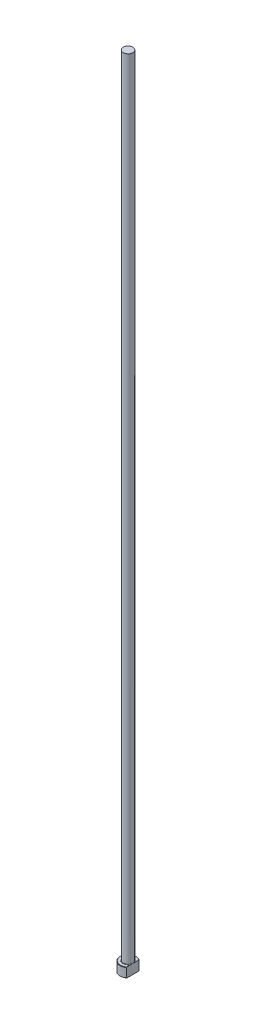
ISO-10303-21;
HEADER;
FILE_DESCRIPTION(('STEP AP214'),'2;1');
FILE_NAME('part.step','',(''),(''),'','','');
FILE_SCHEMA(('AUTOMOTIVE_DESIGN { 1 0 10303 214 1 1 1 1 }'));
ENDSEC;
DATA;
#1=APPLICATION_CONTEXT('core data for automotive mechanical design processes');
#2=APPLICATION_PROTOCOL_DEFINITION('international standard','automotive_design',2000,#1);
#3=PRODUCT_CONTEXT('',#1,'mechanical');
#4=PRODUCT('Part','Part','',(#3));
#5=PRODUCT_RELATED_PRODUCT_CATEGORY('part','',(#4));
#6=PRODUCT_DEFINITION_FORMATION('','',#4);
#7=PRODUCT_DEFINITION_CONTEXT('part definition',#1,'design');
#8=PRODUCT_DEFINITION('design','',#6,#7);
#9=PRODUCT_DEFINITION_SHAPE('','',#8);
#10=(LENGTH_UNIT() NAMED_UNIT(*) SI_UNIT(.MILLI.,.METRE.));
#11=(NAMED_UNIT(*) PLANE_ANGLE_UNIT() SI_UNIT($,.RADIAN.));
#12=(NAMED_UNIT(*) SI_UNIT($,.STERADIAN.) SOLID_ANGLE_UNIT());
#13=UNCERTAINTY_MEASURE_WITH_UNIT(LENGTH_MEASURE(1.E-05),#10,'distance_accuracy_value','');
#14=(GEOMETRIC_REPRESENTATION_CONTEXT(3) GLOBAL_UNCERTAINTY_ASSIGNED_CONTEXT((#13)) GLOBAL_UNIT_ASSIGNED_CONTEXT((#10,
#11,#12)) REPRESENTATION_CONTEXT('',''));
#15=CARTESIAN_POINT('',(0.,0.,0.));
#16=DIRECTION('',(0.,0.,1.));
#17=DIRECTION('',(1.,0.,0.));
#18=AXIS2_PLACEMENT_3D('',#15,#16,#17);
#19=CARTESIAN_POINT('',(0.,0.,0.));
#20=DIRECTION('',(0.,-1.,0.));
#21=DIRECTION('',(0.,0.,-1.));
#22=AXIS2_PLACEMENT_3D('',#19,#20,#21);
#23=PLANE('',#22);
#24=CARTESIAN_POINT('',(0.,0.,0.));
#25=DIRECTION('',(0.,-1.,0.));
#26=DIRECTION('',(0.,0.,-1.));
#27=AXIS2_PLACEMENT_3D('',#24,#25,#26);
#28=CIRCLE('',#27,4.79999999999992);
#29=CARTESIAN_POINT('',(2.99999999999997,0.,3.74699879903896));
#30=VERTEX_POINT('',#29);
#31=CARTESIAN_POINT('',(2.99999999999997,0.,-3.74699879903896));
#32=VERTEX_POINT('',#31);
#33=EDGE_CURVE('E98',#30,#32,#28,.T.);
#34=ORIENTED_EDGE('',*,*,#33,.T.);
#35=DIRECTION('',(0.,0.,1.));
#36=VECTOR('',#35,1.);
#37=CARTESIAN_POINT('',(2.99999999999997,0.,3.99999999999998));
#38=LINE('',#37,#36);
#39=EDGE_CURVE('E83',#32,#30,#38,.T.);
#40=ORIENTED_EDGE('',*,*,#39,.T.);
#41=EDGE_LOOP('',(#34,#40));
#42=FACE_BOUND('',#41,.T.);
#43=ADVANCED_FACE('F32',(#42),#23,.T.);
#44=CARTESIAN_POINT('',(0.,259.958771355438,0.));
#45=DIRECTION('',(0.,1.,0.));
#46=DIRECTION('',(0.,0.,1.));
#47=AXIS2_PLACEMENT_3D('',#44,#45,#46);
#48=CYLINDRICAL_SURFACE('',#47,4.99999999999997);
#49=CARTESIAN_POINT('',(0.,5.79999999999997,0.));
#50=DIRECTION('',(0.,1.,0.));
#51=DIRECTION('',(0.,0.,1.));
#52=AXIS2_PLACEMENT_3D('',#49,#50,#51);
#53=CIRCLE('',#52,4.99999999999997);
#54=CARTESIAN_POINT('',(2.99999999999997,5.79999999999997,3.99999999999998));
#55=VERTEX_POINT('',#54);
#56=CARTESIAN_POINT('',(2.99999999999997,5.79999999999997,-3.99999999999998));
#57=VERTEX_POINT('',#56);
#58=EDGE_CURVE('E104',#55,#57,#53,.F.);
#59=ORIENTED_EDGE('',*,*,#58,.T.);
#60=DIRECTION('',(0.,-1.,0.));
#61=VECTOR('',#60,1.);
#62=CARTESIAN_POINT('',(2.99999999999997,500.,-3.99999999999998));
#63=LINE('',#62,#61);
#64=CARTESIAN_POINT('',(2.99999999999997,0.200000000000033,-3.99999999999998));
#65=VERTEX_POINT('',#64);
#66=EDGE_CURVE('E183',#57,#65,#63,.T.);
#67=ORIENTED_EDGE('',*,*,#66,.T.);
#68=CARTESIAN_POINT('',(0.,0.200000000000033,0.));
#69=DIRECTION('',(0.,-1.,0.));
#70=DIRECTION('',(0.,0.,-1.));
#71=AXIS2_PLACEMENT_3D('',#68,#69,#70);
#72=CIRCLE('',#71,4.99999999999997);
#73=CARTESIAN_POINT('',(2.99999999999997,0.200000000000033,3.99999999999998));
#74=VERTEX_POINT('',#73);
#75=EDGE_CURVE('E100',#65,#74,#72,.F.);
#76=ORIENTED_EDGE('',*,*,#75,.T.);
#77=DIRECTION('',(0.,-1.,0.));
#78=VECTOR('',#77,1.);
#79=CARTESIAN_POINT('',(2.99999999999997,500.,3.99999999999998));
#80=LINE('',#79,#78);
#81=EDGE_CURVE('E93',#55,#74,#80,.T.);
#82=ORIENTED_EDGE('',*,*,#81,.F.);
#83=EDGE_LOOP('',(#59,#67,#76,#82));
#84=FACE_BOUND('',#83,.T.);
#85=ADVANCED_FACE('F158',(#84),#48,.T.);
#86=CARTESIAN_POINT('',(-4.99999999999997,6.,0.));
#87=DIRECTION('',(0.,1.,0.));
#88=DIRECTION('',(0.,0.,1.));
#89=AXIS2_PLACEMENT_3D('',#86,#87,#88);
#90=PLANE('',#89);
#91=CARTESIAN_POINT('',(0.,6.,0.));
#92=DIRECTION('',(0.,1.,0.));
#93=DIRECTION('',(0.,0.,1.));
#94=AXIS2_PLACEMENT_3D('',#91,#92,#93);
#95=CIRCLE('',#94,4.79999999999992);
#96=CARTESIAN_POINT('',(2.99999999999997,6.,-3.74699879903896));
#97=VERTEX_POINT('',#96);
#98=CARTESIAN_POINT('',(2.99999999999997,6.,3.74699879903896));
#99=VERTEX_POINT('',#98);
#100=EDGE_CURVE('E178',#97,#99,#95,.T.);
#101=ORIENTED_EDGE('',*,*,#100,.T.);
#102=DIRECTION('',(0.,0.,-1.));
#103=VECTOR('',#102,1.);
#104=CARTESIAN_POINT('',(2.99999999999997,6.,0.));
#105=LINE('',#104,#103);
#106=CARTESIAN_POINT('',(2.99999999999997,5.99999999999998,1.11355287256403));
#107=VERTEX_POINT('',#106);
#108=EDGE_CURVE('E57',#99,#107,#105,.T.);
#109=ORIENTED_EDGE('',*,*,#108,.T.);
#110=CARTESIAN_POINT('',(0.,6.,0.));
#111=DIRECTION('',(0.,1.,0.));
#112=DIRECTION('',(0.,0.,1.));
#113=AXIS2_PLACEMENT_3D('',#110,#111,#112);
#114=CIRCLE('',#113,3.19999999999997);
#115=CARTESIAN_POINT('',(2.99999999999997,5.99999999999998,-1.113552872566));
#116=VERTEX_POINT('',#115);
#117=EDGE_CURVE('E107',#107,#116,#114,.F.);
#118=ORIENTED_EDGE('',*,*,#117,.T.);
#119=EDGE_CURVE('E136',#116,#97,#105,.T.);
#120=ORIENTED_EDGE('',*,*,#119,.T.);
#121=EDGE_LOOP('',(#101,#109,#118,#120));
#122=FACE_BOUND('',#121,.T.);
#123=ADVANCED_FACE('F147',(#122),#90,.T.);
#124=CARTESIAN_POINT('',(0.,6.00000000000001,0.));
#125=DIRECTION('',(0.,-1.,0.));
#126=DIRECTION('',(0.,0.,-1.));
#127=AXIS2_PLACEMENT_3D('',#124,#125,#126);
#128=CONICAL_SURFACE('',#127,4.79999999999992,0.785398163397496);
#129=ORIENTED_EDGE('',*,*,#58,.F.);
#130=CARTESIAN_POINT('',(2.99999999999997,1.50107969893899,8.80169976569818));
#131=CARTESIAN_POINT('',(2.99999999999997,1.63686222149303,8.65824370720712));
#132=CARTESIAN_POINT('',(2.99999999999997,1.77246571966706,8.51461803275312));
#133=CARTESIAN_POINT('',(2.99999999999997,2.04325136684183,8.22696847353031));
#134=CARTESIAN_POINT('',(2.99999999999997,2.17843351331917,8.0829445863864));
#135=CARTESIAN_POINT('',(2.99999999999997,2.58356488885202,7.6498536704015));
#136=CARTESIAN_POINT('',(2.99999999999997,2.85278243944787,7.3601013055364));
#137=CARTESIAN_POINT('',(2.99999999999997,3.40003551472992,6.76562093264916));
#138=CARTESIAN_POINT('',(2.99999999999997,3.67795327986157,6.4607841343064));
#139=CARTESIAN_POINT('',(2.99999999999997,4.09143431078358,6.00077575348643));
#140=CARTESIAN_POINT('',(2.99999999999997,4.22862197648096,5.84706478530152));
#141=CARTESIAN_POINT('',(2.99999999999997,4.50164803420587,5.5384501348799));
#142=CARTESIAN_POINT('',(2.99999999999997,4.6374864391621,5.38354646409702));
#143=CARTESIAN_POINT('',(2.99999999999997,4.90727601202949,5.07249257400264));
#144=CARTESIAN_POINT('',(2.99999999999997,5.04122961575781,4.91634447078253));
#145=CARTESIAN_POINT('',(2.99999999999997,5.30697993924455,4.60220522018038));
#146=CARTESIAN_POINT('',(2.99999999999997,5.43877654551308,4.44421397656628));
#147=CARTESIAN_POINT('',(2.99999999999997,5.69999683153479,4.12534042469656));
#148=CARTESIAN_POINT('',(2.99999999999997,5.82941047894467,3.96444987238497));
#149=CARTESIAN_POINT('',(2.99999999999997,6.08438250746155,3.63966784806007));
#150=CARTESIAN_POINT('',(2.99999999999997,6.20994148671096,3.4757768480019));
#151=CARTESIAN_POINT('',(2.99999999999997,6.45325581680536,3.1473981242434));
#152=CARTESIAN_POINT('',(2.99999999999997,6.57111776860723,2.9829898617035));
#153=CARTESIAN_POINT('',(2.99999999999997,6.79968625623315,2.64903166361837));
#154=CARTESIAN_POINT('',(2.99999999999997,6.91038738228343,2.47947797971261));
#155=CARTESIAN_POINT('',(2.99999999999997,7.12046597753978,2.13484547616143));
#156=CARTESIAN_POINT('',(2.99999999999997,7.21990868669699,1.95980688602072));
#157=CARTESIAN_POINT('',(2.99999999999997,7.40271732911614,1.60161809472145));
#158=CARTESIAN_POINT('',(2.99999999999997,7.48611382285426,1.41848414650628));
#159=CARTESIAN_POINT('',(2.99999999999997,7.59087391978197,1.14242184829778));
#160=CARTESIAN_POINT('',(2.99999999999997,7.62169870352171,1.05308812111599));
#161=CARTESIAN_POINT('',(2.99999999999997,7.67691431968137,0.872393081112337));
#162=CARTESIAN_POINT('',(2.99999999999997,7.70130307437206,0.781031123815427));
#163=CARTESIAN_POINT('',(2.99999999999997,7.74245942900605,0.597105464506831));
#164=CARTESIAN_POINT('',(2.99999999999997,7.75926776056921,0.504551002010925));
#165=CARTESIAN_POINT('',(2.99999999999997,7.78456917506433,0.318316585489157));
#166=CARTESIAN_POINT('',(2.99999999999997,7.79306431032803,0.224636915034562));
#167=CARTESIAN_POINT('',(2.99999999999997,7.80126723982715,0.0362345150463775));
#168=CARTESIAN_POINT('',(2.99999999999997,7.80091364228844,-0.0584909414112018));
#169=CARTESIAN_POINT('',(2.99999999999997,7.7912899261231,-0.247479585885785));
#170=CARTESIAN_POINT('',(2.99999999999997,7.78201974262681,-0.341742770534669));
#171=CARTESIAN_POINT('',(2.99999999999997,7.75505711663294,-0.529484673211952));
#172=CARTESIAN_POINT('',(2.99999999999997,7.73732579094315,-0.622957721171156));
#173=CARTESIAN_POINT('',(2.99999999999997,7.69436193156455,-0.808152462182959));
#174=CARTESIAN_POINT('',(2.99999999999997,7.66912783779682,-0.899873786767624));
#175=CARTESIAN_POINT('',(2.99999999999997,7.59536615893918,-1.13513447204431));
#176=CARTESIAN_POINT('',(2.99999999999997,7.54190202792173,-1.27712290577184));
#177=CARTESIAN_POINT('',(2.99999999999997,7.42288064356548,-1.55591594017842));
#178=CARTESIAN_POINT('',(2.99999999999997,7.35731341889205,-1.69271615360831));
#179=CARTESIAN_POINT('',(2.99999999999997,7.21673004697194,-1.96297343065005));
#180=CARTESIAN_POINT('',(2.99999999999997,7.14163008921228,-2.09638641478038));
#181=CARTESIAN_POINT('',(2.99999999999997,7.0240988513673,-2.29351148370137));
#182=CARTESIAN_POINT('',(2.99999999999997,6.98411579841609,-2.35870939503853));
#183=CARTESIAN_POINT('',(2.99999999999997,6.90273519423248,-2.48821412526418));
#184=CARTESIAN_POINT('',(2.99999999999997,6.86133769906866,-2.55252097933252));
#185=CARTESIAN_POINT('',(2.99999999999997,6.72108058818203,-2.7659208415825));
#186=CARTESIAN_POINT('',(2.99999999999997,6.61950942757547,-2.91323263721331));
#187=CARTESIAN_POINT('',(2.99999999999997,6.41158682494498,-3.20445576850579));
#188=CARTESIAN_POINT('',(2.99999999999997,6.3052343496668,-3.3483663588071));
#189=CARTESIAN_POINT('',(2.99999999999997,6.08891481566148,-3.63358820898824));
#190=CARTESIAN_POINT('',(2.99999999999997,5.97894537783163,-3.77489765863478));
#191=CARTESIAN_POINT('',(2.99999999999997,5.75630759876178,-4.05537908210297));
#192=CARTESIAN_POINT('',(2.99999999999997,5.64363910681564,-4.19455093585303));
#193=CARTESIAN_POINT('',(2.99999999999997,5.41585487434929,-4.47160548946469));
#194=CARTESIAN_POINT('',(2.99999999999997,5.30073257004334,-4.6094827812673));
#195=CARTESIAN_POINT('',(2.99999999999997,5.06881951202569,-4.88382857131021));
#196=CARTESIAN_POINT('',(2.99999999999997,4.95202872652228,-5.02029704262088));
#197=CARTESIAN_POINT('',(2.99999999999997,4.59976429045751,-5.42786401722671));
#198=CARTESIAN_POINT('',(2.99999999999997,4.36230070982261,-5.69724186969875));
#199=CARTESIAN_POINT('',(2.99999999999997,3.90791057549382,-6.20584337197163));
#200=CARTESIAN_POINT('',(2.99999999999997,3.69132371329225,-6.4453721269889));
#201=CARTESIAN_POINT('',(2.99999999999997,3.2560075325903,-6.92252604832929));
#202=CARTESIAN_POINT('',(2.99999999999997,3.03727796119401,-7.16015098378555));
#203=CARTESIAN_POINT('',(2.99999999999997,2.59963438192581,-7.63242038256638));
#204=CARTESIAN_POINT('',(2.99999999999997,2.38073043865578,-7.86707418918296));
#205=CARTESIAN_POINT('',(2.99999999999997,1.9417265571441,-8.33519393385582));
#206=CARTESIAN_POINT('',(2.99999999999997,1.7216268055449,-8.56866004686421));
#207=CARTESIAN_POINT('',(2.99999999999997,1.50107969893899,-8.80169976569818));
#208=B_SPLINE_CURVE_WITH_KNOTS('',3,(#130,#131,#132,#133,#134,#135,#136,#137,#138,#139,#140,
#141,#142,#143,#144,#145,#146,#147,#148,#149,#150,#151,#152,#153,#154,#155,#156,#157,#158,#159,
#160,#161,#162,#163,#164,#165,#166,#167,#168,#169,#170,#171,#172,#173,#174,#175,#176,#177,#178,
#179,#180,#181,#182,#183,#184,#185,#186,#187,#188,#189,#190,#191,#192,#193,#194,#195,#196,#197,
#198,#199,#200,#201,#202,#203,#204,#205,#206,#207),.UNSPECIFIED.,.F.,.F.,(4,2,2,2,2,2,2,2,2,2,2,
2,2,2,2,2,2,2,2,2,2,2,2,2,2,2,2,2,2,2,2,2,2,2,2,2,2,2,4),(0.,0.5925780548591,1.18515965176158,
2.37170329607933,3.60919781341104,4.22727570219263,4.84534766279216,5.46252965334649,
6.07974401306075,6.69913968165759,7.31843874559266,7.92518229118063,8.5323789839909,
9.135854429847,9.73816890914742,10.0214813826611,10.3048852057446,10.5867475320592,
10.8685402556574,11.152288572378,11.436038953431,11.7211060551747,12.0062324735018,
12.4605654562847,12.9152744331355,13.3743011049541,13.6037325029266,13.8331548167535,
14.3698070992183,14.9065759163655,15.4437051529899,15.9808644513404,16.5197074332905,
17.0585606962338,18.1358079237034,19.1045853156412,20.0734784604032,21.0361950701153,
21.9987655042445),.UNSPECIFIED.);
#209=EDGE_CURVE('E135',#55,#99,#208,.T.);
#210=ORIENTED_EDGE('',*,*,#209,.T.);
#211=ORIENTED_EDGE('',*,*,#100,.F.);
#212=EDGE_CURVE('E127',#97,#57,#208,.T.);
#213=ORIENTED_EDGE('',*,*,#212,.T.);
#214=EDGE_LOOP('',(#129,#210,#211,#213));
#215=FACE_BOUND('',#214,.T.);
#216=ADVANCED_FACE('F143',(#215),#128,.T.);
#217=CARTESIAN_POINT('',(0.,0.200000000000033,0.));
#218=DIRECTION('',(0.,1.,0.));
#219=DIRECTION('',(0.,0.,1.));
#220=AXIS2_PLACEMENT_3D('',#217,#218,#219);
#221=CONICAL_SURFACE('',#220,4.99999999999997,0.785398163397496);
#222=ORIENTED_EDGE('',*,*,#75,.F.);
#223=CARTESIAN_POINT('',(2.99999999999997,4.49892030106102,-8.80169976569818));
#224=CARTESIAN_POINT('',(2.99999999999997,4.36313777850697,-8.65824370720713));
#225=CARTESIAN_POINT('',(2.99999999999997,4.22753428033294,-8.51461803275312));
#226=CARTESIAN_POINT('',(2.99999999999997,3.95674863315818,-8.22696847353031));
#227=CARTESIAN_POINT('',(2.99999999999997,3.82156648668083,-8.0829445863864));
#228=CARTESIAN_POINT('',(2.99999999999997,3.41643511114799,-7.6498536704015));
#229=CARTESIAN_POINT('',(2.99999999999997,3.14721756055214,-7.3601013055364));
#230=CARTESIAN_POINT('',(2.99999999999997,2.59996448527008,-6.76562093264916));
#231=CARTESIAN_POINT('',(2.99999999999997,2.32204672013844,-6.4607841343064));
#232=CARTESIAN_POINT('',(2.99999999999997,1.90856568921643,-6.00077575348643));
#233=CARTESIAN_POINT('',(2.99999999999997,1.77137802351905,-5.84706478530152));
#234=CARTESIAN_POINT('',(2.99999999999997,1.49835196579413,-5.5384501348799));
#235=CARTESIAN_POINT('',(2.99999999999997,1.36251356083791,-5.38354646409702));
#236=CARTESIAN_POINT('',(2.99999999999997,1.09272398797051,-5.07249257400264));
#237=CARTESIAN_POINT('',(2.99999999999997,0.9587703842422,-4.91634447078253));
#238=CARTESIAN_POINT('',(2.99999999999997,0.693020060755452,-4.60220522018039));
#239=CARTESIAN_POINT('',(2.99999999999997,0.561223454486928,-4.44421397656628));
#240=CARTESIAN_POINT('',(2.99999999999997,0.300003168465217,-4.12534042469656));
#241=CARTESIAN_POINT('',(2.99999999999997,0.170589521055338,-3.96444987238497));
#242=CARTESIAN_POINT('',(2.99999999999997,-0.084382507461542,-3.63966784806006));
#243=CARTESIAN_POINT('',(2.99999999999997,-0.209941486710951,-3.4757768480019));
#244=CARTESIAN_POINT('',(2.99999999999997,-0.453255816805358,-3.1473981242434));
#245=CARTESIAN_POINT('',(2.99999999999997,-0.571117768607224,-2.9829898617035));
#246=CARTESIAN_POINT('',(2.99999999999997,-0.799686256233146,-2.64903166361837));
#247=CARTESIAN_POINT('',(2.99999999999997,-0.910387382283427,-2.47947797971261));
#248=CARTESIAN_POINT('',(2.99999999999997,-1.12046597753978,-2.13484547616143));
#249=CARTESIAN_POINT('',(2.99999999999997,-1.21990868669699,-1.95980688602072));
#250=CARTESIAN_POINT('',(2.99999999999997,-1.40271732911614,-1.60161809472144));
#251=CARTESIAN_POINT('',(2.99999999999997,-1.48611382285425,-1.41848414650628));
#252=CARTESIAN_POINT('',(2.99999999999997,-1.59087391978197,-1.14242184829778));
#253=CARTESIAN_POINT('',(2.99999999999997,-1.62169870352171,-1.05308812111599));
#254=CARTESIAN_POINT('',(2.99999999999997,-1.67691431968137,-0.872393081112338));
#255=CARTESIAN_POINT('',(2.99999999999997,-1.70130307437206,-0.781031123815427));
#256=CARTESIAN_POINT('',(2.99999999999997,-1.74245942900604,-0.59710546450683));
#257=CARTESIAN_POINT('',(2.99999999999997,-1.7592677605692,-0.504551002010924));
#258=CARTESIAN_POINT('',(2.99999999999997,-1.78456917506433,-0.318316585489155));
#259=CARTESIAN_POINT('',(2.99999999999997,-1.79306431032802,-0.22463691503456));
#260=CARTESIAN_POINT('',(2.99999999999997,-1.80126723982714,-0.0362345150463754));
#261=CARTESIAN_POINT('',(2.99999999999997,-1.80091364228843,0.0584909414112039));
#262=CARTESIAN_POINT('',(2.99999999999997,-1.79128992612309,0.247479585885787));
#263=CARTESIAN_POINT('',(2.99999999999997,-1.7820197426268,0.341742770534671));
#264=CARTESIAN_POINT('',(2.99999999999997,-1.75505711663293,0.529484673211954));
#265=CARTESIAN_POINT('',(2.99999999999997,-1.73732579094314,0.622957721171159));
#266=CARTESIAN_POINT('',(2.99999999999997,-1.69436193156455,0.808152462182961));
#267=CARTESIAN_POINT('',(2.99999999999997,-1.66912783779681,0.899873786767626));
#268=CARTESIAN_POINT('',(2.99999999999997,-1.59536615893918,1.13513447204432));
#269=CARTESIAN_POINT('',(2.99999999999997,-1.54190202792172,1.27712290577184));
#270=CARTESIAN_POINT('',(2.99999999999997,-1.42288064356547,1.55591594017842));
#271=CARTESIAN_POINT('',(2.99999999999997,-1.35731341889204,1.69271615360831));
#272=CARTESIAN_POINT('',(2.99999999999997,-1.21673004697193,1.96297343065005));
#273=CARTESIAN_POINT('',(2.99999999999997,-1.14163008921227,2.09638641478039));
#274=CARTESIAN_POINT('',(2.99999999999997,-1.02409885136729,2.29351148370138));
#275=CARTESIAN_POINT('',(2.99999999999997,-0.98411579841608,2.35870939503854));
#276=CARTESIAN_POINT('',(2.99999999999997,-0.902735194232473,2.48821412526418));
#277=CARTESIAN_POINT('',(2.99999999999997,-0.861337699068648,2.55252097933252));
#278=CARTESIAN_POINT('',(2.99999999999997,-0.721080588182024,2.7659208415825));
#279=CARTESIAN_POINT('',(2.99999999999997,-0.619509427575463,2.91323263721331));
#280=CARTESIAN_POINT('',(2.99999999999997,-0.411586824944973,3.20445576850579));
#281=CARTESIAN_POINT('',(2.99999999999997,-0.305234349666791,3.3483663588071));
#282=CARTESIAN_POINT('',(2.99999999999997,-0.0889148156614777,3.63358820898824));
#283=CARTESIAN_POINT('',(2.99999999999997,0.0210546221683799,3.77489765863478));
#284=CARTESIAN_POINT('',(2.99999999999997,0.24369240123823,4.05537908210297));
#285=CARTESIAN_POINT('',(2.99999999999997,0.356360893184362,4.19455093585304));
#286=CARTESIAN_POINT('',(2.99999999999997,0.584145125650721,4.47160548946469));
#287=CARTESIAN_POINT('',(2.99999999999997,0.699267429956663,4.6094827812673));
#288=CARTESIAN_POINT('',(2.99999999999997,0.931180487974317,4.88382857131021));
#289=CARTESIAN_POINT('',(2.99999999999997,1.04797127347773,5.02029704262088));
#290=CARTESIAN_POINT('',(2.99999999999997,1.40023570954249,5.42786401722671));
#291=CARTESIAN_POINT('',(2.99999999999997,1.6376992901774,5.69724186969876));
#292=CARTESIAN_POINT('',(2.99999999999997,2.09208942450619,6.20584337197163));
#293=CARTESIAN_POINT('',(2.99999999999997,2.30867628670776,6.44537212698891));
#294=CARTESIAN_POINT('',(2.99999999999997,2.7439924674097,6.92252604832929));
#295=CARTESIAN_POINT('',(2.99999999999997,2.96272203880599,7.16015098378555));
#296=CARTESIAN_POINT('',(2.99999999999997,3.4003656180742,7.63242038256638));
#297=CARTESIAN_POINT('',(2.99999999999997,3.61926956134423,7.86707418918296));
#298=CARTESIAN_POINT('',(2.99999999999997,4.05827344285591,8.33519393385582));
#299=CARTESIAN_POINT('',(2.99999999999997,4.27837319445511,8.56866004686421));
#300=CARTESIAN_POINT('',(2.99999999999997,4.49892030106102,8.80169976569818));
#301=B_SPLINE_CURVE_WITH_KNOTS('',3,(#223,#224,#225,#226,#227,#228,#229,#230,#231,#232,#233,
#234,#235,#236,#237,#238,#239,#240,#241,#242,#243,#244,#245,#246,#247,#248,#249,#250,#251,#252,
#253,#254,#255,#256,#257,#258,#259,#260,#261,#262,#263,#264,#265,#266,#267,#268,#269,#270,#271,
#272,#273,#274,#275,#276,#277,#278,#279,#280,#281,#282,#283,#284,#285,#286,#287,#288,#289,#290,
#291,#292,#293,#294,#295,#296,#297,#298,#299,#300),.UNSPECIFIED.,.F.,.F.,(4,2,2,2,2,2,2,2,2,2,2,
2,2,2,2,2,2,2,2,2,2,2,2,2,2,2,2,2,2,2,2,2,2,2,2,2,2,2,4),(0.,0.5925780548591,1.18515965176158,
2.37170329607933,3.60919781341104,4.22727570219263,4.84534766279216,5.46252965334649,
6.07974401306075,6.6991396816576,7.31843874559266,7.92518229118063,8.53237898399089,
9.135854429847,9.73816890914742,10.0214813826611,10.3048852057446,10.5867475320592,
10.8685402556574,11.152288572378,11.436038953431,11.7211060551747,12.0062324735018,
12.4605654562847,12.9152744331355,13.3743011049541,13.6037325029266,13.8331548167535,
14.3698070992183,14.9065759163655,15.4437051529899,15.9808644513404,16.5197074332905,
17.0585606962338,18.1358079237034,19.1045853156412,20.0734784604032,21.0361950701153,
21.9987655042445),.UNSPECIFIED.);
#302=EDGE_CURVE('E86',#65,#32,#301,.T.);
#303=ORIENTED_EDGE('',*,*,#302,.T.);
#304=ORIENTED_EDGE('',*,*,#33,.F.);
#305=EDGE_CURVE('E89',#30,#74,#301,.T.);
#306=ORIENTED_EDGE('',*,*,#305,.T.);
#307=EDGE_LOOP('',(#222,#303,#304,#306));
#308=FACE_BOUND('',#307,.T.);
#309=ADVANCED_FACE('F97',(#308),#221,.T.);
#310=CARTESIAN_POINT('',(0.,6.19999999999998,0.));
#311=DIRECTION('',(0.,1.,0.));
#312=DIRECTION('',(0.,0.,1.));
#313=AXIS2_PLACEMENT_3D('',#310,#311,#312);
#314=TOROIDAL_SURFACE('',#313,3.19999999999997,0.2);
#315=CARTESIAN_POINT('',(2.99999999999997,6.19999999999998,0.));
#316=CARTESIAN_POINT('',(2.99999999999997,6.20000054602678,-8.25590029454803E-09));
#317=CARTESIAN_POINT('',(2.99999999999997,6.20000108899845,-2.22623717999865E-07));
#318=CARTESIAN_POINT('',(2.99999999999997,6.20000210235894,-8.13181332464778E-07));
#319=CARTESIAN_POINT('',(2.99999999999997,6.20000256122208,-1.20262210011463E-06));
#320=CARTESIAN_POINT('',(2.99999999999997,6.20000351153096,-2.13233194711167E-06));
#321=CARTESIAN_POINT('',(2.99999999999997,6.20000398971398,-2.68711080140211E-06));
#322=CARTESIAN_POINT('',(2.99999999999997,6.20000484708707,-3.8372299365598E-06));
#323=CARTESIAN_POINT('',(2.99999999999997,6.20000522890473,-4.43075975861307E-06));
#324=CARTESIAN_POINT('',(2.99999999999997,6.20000663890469,-6.718054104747E-06));
#325=CARTESIAN_POINT('',(2.99999999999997,6.20000758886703,-8.46267334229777E-06));
#326=CARTESIAN_POINT('',(2.99999999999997,6.20000915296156,-1.19195939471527E-05));
#327=CARTESIAN_POINT('',(2.99999999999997,6.20000978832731,-1.36226968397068E-05));
#328=CARTESIAN_POINT('',(2.99999999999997,6.20001243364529,-2.07785329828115E-05));
#329=CARTESIAN_POINT('',(2.99999999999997,6.20001439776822,-2.62512689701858E-05));
#330=CARTESIAN_POINT('',(2.99999999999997,6.20001730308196,-3.65971254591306E-05));
#331=CARTESIAN_POINT('',(2.99999999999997,6.20001835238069,-4.14397204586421E-05));
#332=CARTESIAN_POINT('',(2.99999999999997,6.20002589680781,-7.68826112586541E-05));
#333=CARTESIAN_POINT('',(2.99999999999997,6.20003169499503,-0.000107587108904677));
#334=CARTESIAN_POINT('',(2.99999999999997,6.20005649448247,-0.000225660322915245));
#335=CARTESIAN_POINT('',(2.99999999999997,6.20007997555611,-0.000312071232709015));
#336=CARTESIAN_POINT('',(2.99999999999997,6.20016717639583,-0.00063874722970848));
#337=CARTESIAN_POINT('',(2.99999999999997,6.20022823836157,-0.00087949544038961));
#338=CARTESIAN_POINT('',(2.99999999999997,6.20046253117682,-0.00179757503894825));
#339=CARTESIAN_POINT('',(2.99999999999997,6.20063826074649,-0.00247448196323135));
#340=CARTESIAN_POINT('',(2.99999999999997,6.20145771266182,-0.00563611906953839));
#341=CARTESIAN_POINT('',(2.99999999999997,6.20209802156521,-0.00812138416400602));
#342=CARTESIAN_POINT('',(2.99999999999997,6.20747052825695,-0.0289666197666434));
#343=CARTESIAN_POINT('',(2.99999999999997,6.21221441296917,-0.0473249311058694));
#344=CARTESIAN_POINT('',(2.99999999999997,6.22150414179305,-0.0833908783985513));
#345=CARTESIAN_POINT('',(2.99999999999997,6.22605099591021,-0.101098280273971));
#346=CARTESIAN_POINT('',(2.99999999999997,6.24071513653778,-0.158441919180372));
#347=CARTESIAN_POINT('',(2.99999999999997,6.25076238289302,-0.198096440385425));
#348=CARTESIAN_POINT('',(2.99999999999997,6.2673587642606,-0.264903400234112));
#349=CARTESIAN_POINT('',(2.99999999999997,6.27400650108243,-0.292031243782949));
#350=CARTESIAN_POINT('',(2.99999999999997,6.28691139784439,-0.345693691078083));
#351=CARTESIAN_POINT('',(2.99999999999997,6.2931740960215,-0.372226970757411));
#352=CARTESIAN_POINT('',(2.99999999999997,6.31359314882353,-0.460847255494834));
#353=CARTESIAN_POINT('',(2.99999999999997,6.32711949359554,-0.523084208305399));
#354=CARTESIAN_POINT('',(2.99999999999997,6.35185224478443,-0.648627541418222));
#355=CARTESIAN_POINT('',(2.99999999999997,6.36303576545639,-0.711938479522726));
#356=CARTESIAN_POINT('',(2.99999999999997,6.38269719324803,-0.845442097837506));
#357=CARTESIAN_POINT('',(2.99999999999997,6.39079783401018,-0.915695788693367));
#358=CARTESIAN_POINT('',(2.99999999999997,6.39788104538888,-1.02128246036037));
#359=CARTESIAN_POINT('',(2.99999999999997,6.39939945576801,-1.05644278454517));
#360=CARTESIAN_POINT('',(2.99999999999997,6.40031405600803,-1.12678521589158));
#361=CARTESIAN_POINT('',(2.99999999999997,6.39971158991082,-1.16196729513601));
#362=CARTESIAN_POINT('',(2.99999999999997,6.39660553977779,-1.21713951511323));
#363=CARTESIAN_POINT('',(2.99999999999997,6.39502683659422,-1.23718181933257));
#364=CARTESIAN_POINT('',(2.99999999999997,6.39080008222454,-1.27717351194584));
#365=CARTESIAN_POINT('',(2.99999999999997,6.38815120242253,-1.29712281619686));
#366=CARTESIAN_POINT('',(2.99999999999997,6.38160570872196,-1.33655702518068));
#367=CARTESIAN_POINT('',(2.99999999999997,6.37772556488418,-1.35604460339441));
#368=CARTESIAN_POINT('',(2.99999999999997,6.36841119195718,-1.39463554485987));
#369=CARTESIAN_POINT('',(2.99999999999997,6.36297874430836,-1.41373932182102));
#370=CARTESIAN_POINT('',(2.99999999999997,6.3500393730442,-1.45151809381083));
#371=CARTESIAN_POINT('',(2.99999999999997,6.34250654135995,-1.4701843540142));
#372=CARTESIAN_POINT('',(2.99999999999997,6.32469433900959,-1.50617232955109));
#373=CARTESIAN_POINT('',(2.99999999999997,6.31442814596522,-1.52349999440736));
#374=CARTESIAN_POINT('',(2.99999999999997,6.29768486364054,-1.5453003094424));
#375=CARTESIAN_POINT('',(2.99999999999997,6.29285641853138,-1.551032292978));
#376=CARTESIAN_POINT('',(2.99999999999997,6.28257691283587,-1.56192749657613));
#377=CARTESIAN_POINT('',(2.99999999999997,6.27712536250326,-1.56709026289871));
#378=CARTESIAN_POINT('',(2.99999999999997,6.26548354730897,-1.57666725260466));
#379=CARTESIAN_POINT('',(2.99999999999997,6.25928560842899,-1.58107232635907));
#380=CARTESIAN_POINT('',(2.99999999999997,6.24620912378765,-1.5887219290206));
#381=CARTESIAN_POINT('',(2.99999999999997,6.23933242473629,-1.59196950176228));
#382=CARTESIAN_POINT('',(2.99999999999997,6.2270240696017,-1.5962468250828));
#383=CARTESIAN_POINT('',(2.99999999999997,6.2217197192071,-1.59764171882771));
#384=CARTESIAN_POINT('',(2.99999999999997,6.2109516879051,-1.59951721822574));
#385=CARTESIAN_POINT('',(2.99999999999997,6.20548813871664,-1.59999855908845));
#386=CARTESIAN_POINT('',(2.99999999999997,6.19455397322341,-1.60000143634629));
#387=CARTESIAN_POINT('',(2.99999999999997,6.18908335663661,-1.59952177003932));
#388=CARTESIAN_POINT('',(2.99999999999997,6.17830149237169,-1.59764696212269));
#389=CARTESIAN_POINT('',(2.99999999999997,6.17299036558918,-1.59625114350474));
#390=CARTESIAN_POINT('',(2.99999999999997,6.16137413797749,-1.5922159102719));
#391=CARTESIAN_POINT('',(2.99999999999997,6.15514663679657,-1.58935479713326));
#392=CARTESIAN_POINT('',(2.99999999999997,6.14323789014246,-1.58266473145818));
#393=CARTESIAN_POINT('',(2.99999999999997,6.13755768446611,-1.57883398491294));
#394=CARTESIAN_POINT('',(2.99999999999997,6.12388989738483,-1.5682309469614));
#395=CARTESIAN_POINT('',(2.99999999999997,6.11627920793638,-1.5609769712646));
#396=CARTESIAN_POINT('',(2.99999999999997,6.10222993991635,-1.54541986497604));
#397=CARTESIAN_POINT('',(2.99999999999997,6.09579438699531,-1.53711411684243));
#398=CARTESIAN_POINT('',(2.99999999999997,6.07874447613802,-1.51234359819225));
#399=CARTESIAN_POINT('',(2.99999999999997,6.06934681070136,-1.49505024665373));
#400=CARTESIAN_POINT('',(2.99999999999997,6.05300413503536,-1.45936637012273));
#401=CARTESIAN_POINT('',(2.99999999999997,6.04606563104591,-1.44097308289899));
#402=CARTESIAN_POINT('',(2.99999999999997,6.03343712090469,-1.40170303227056));
#403=CARTESIAN_POINT('',(2.99999999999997,6.02794514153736,-1.38076360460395));
#404=CARTESIAN_POINT('',(2.99999999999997,6.01869119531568,-1.33849708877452));
#405=CARTESIAN_POINT('',(2.99999999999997,6.01493126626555,-1.31716957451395));
#406=CARTESIAN_POINT('',(2.99999999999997,6.00879575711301,-1.27427301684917));
#407=CARTESIAN_POINT('',(2.99999999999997,6.0064232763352,-1.25270354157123));
#408=CARTESIAN_POINT('',(2.99999999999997,6.00283272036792,-1.2094871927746));
#409=CARTESIAN_POINT('',(2.99999999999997,6.00161392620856,-1.18784037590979));
#410=CARTESIAN_POINT('',(2.99999999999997,5.99921193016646,-1.11739576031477));
#411=CARTESIAN_POINT('',(2.99999999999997,5.99998309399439,-1.06853061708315));
#412=CARTESIAN_POINT('',(2.99999999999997,6.0049845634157,-0.970964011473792));
#413=CARTESIAN_POINT('',(2.99999999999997,6.00921876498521,-0.922262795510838));
#414=CARTESIAN_POINT('',(2.99999999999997,6.02027934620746,-0.825023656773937));
#415=CARTESIAN_POINT('',(2.99999999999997,6.02711306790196,-0.776486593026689));
#416=CARTESIAN_POINT('',(2.99999999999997,6.04272509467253,-0.679720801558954));
#417=CARTESIAN_POINT('',(2.99999999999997,6.05150395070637,-0.631492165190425));
#418=CARTESIAN_POINT('',(2.99999999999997,6.07999589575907,-0.487173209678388));
#419=CARTESIAN_POINT('',(2.99999999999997,6.10185558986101,-0.39151417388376));
#420=CARTESIAN_POINT('',(2.99999999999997,6.14819769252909,-0.200831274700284));
#421=CARTESIAN_POINT('',(2.99999999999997,6.17268119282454,-0.105807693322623));
#422=CARTESIAN_POINT('',(2.99999999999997,6.19722910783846,-0.01073189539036));
#423=CARTESIAN_POINT('',(2.99999999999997,6.1972452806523,-0.0106692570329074));
#424=CARTESIAN_POINT('',(2.99999999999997,6.19781243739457,-0.00847232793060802));
#425=CARTESIAN_POINT('',(2.99999999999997,6.19836102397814,-0.00633759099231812));
#426=CARTESIAN_POINT('',(2.99999999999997,6.19915976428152,-0.00325873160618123));
#427=CARTESIAN_POINT('',(2.99999999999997,6.19940591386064,-0.0023138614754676));
#428=CARTESIAN_POINT('',(2.99999999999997,6.19972567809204,-0.00105818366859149));
#429=CARTESIAN_POINT('',(2.99999999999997,6.1998040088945,-0.000748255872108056));
#430=CARTESIAN_POINT('',(2.99999999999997,6.19991224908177,-0.0003408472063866));
#431=CARTESIAN_POINT('',(2.99999999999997,6.19993871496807,-0.000242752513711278));
#432=CARTESIAN_POINT('',(2.99999999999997,6.1999662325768,-0.000111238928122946));
#433=CARTESIAN_POINT('',(2.99999999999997,6.19997237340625,-7.8903777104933E-05));
#434=CARTESIAN_POINT('',(2.99999999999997,6.19998062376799,-4.17973013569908E-05));
#435=CARTESIAN_POINT('',(2.99999999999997,6.1999817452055,-3.68646326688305E-05));
#436=CARTESIAN_POINT('',(2.99999999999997,6.19998486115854,-2.63337098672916E-05));
#437=CARTESIAN_POINT('',(2.99999999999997,6.19998697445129,-2.07707790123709E-05));
#438=CARTESIAN_POINT('',(2.99999999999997,6.19998981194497,-1.35213137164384E-05));
#439=CARTESIAN_POINT('',(2.99999999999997,6.19999048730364,-1.18115060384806E-05));
#440=CARTESIAN_POINT('',(2.99999999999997,6.19999214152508,-8.34771964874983E-06));
#441=CARTESIAN_POINT('',(2.99999999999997,6.19999314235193,-6.60378872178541E-06));
#442=CARTESIAN_POINT('',(2.99999999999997,6.19999462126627,-4.32501646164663E-06));
#443=CARTESIAN_POINT('',(2.99999999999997,6.19999502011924,-3.73587510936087E-06));
#444=CARTESIAN_POINT('',(2.99999999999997,6.19999591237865,-2.59760769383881E-06));
#445=CARTESIAN_POINT('',(2.99999999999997,6.19999640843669,-2.05040430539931E-06));
#446=CARTESIAN_POINT('',(2.99999999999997,6.19999738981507,-1.1384674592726E-06));
#447=CARTESIAN_POINT('',(2.99999999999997,6.1999978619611,-7.58552555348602E-07));
#448=CARTESIAN_POINT('',(2.99999999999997,6.19999889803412,-1.92079007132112E-07));
#449=CARTESIAN_POINT('',(2.99999999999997,6.19999945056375,8.30745072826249E-09));
#450=CARTESIAN_POINT('',(2.99999999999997,6.19999999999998,0.));
#451=B_SPLINE_CURVE_WITH_KNOTS('',3,(#315,#316,#317,#318,#319,#320,#321,#322,#323,#324,#325,
#326,#327,#328,#329,#330,#331,#332,#333,#334,#335,#336,#337,#338,#339,#340,#341,#342,#343,#344,
#345,#346,#347,#348,#349,#350,#351,#352,#353,#354,#355,#356,#357,#358,#359,#360,#361,#362,#363,
#364,#365,#366,#367,#368,#369,#370,#371,#372,#373,#374,#375,#376,#377,#378,#379,#380,#381,#382,
#383,#384,#385,#386,#387,#388,#389,#390,#391,#392,#393,#394,#395,#396,#397,#398,#399,#400,#401,
#402,#403,#404,#405,#406,#407,#408,#409,#410,#411,#412,#413,#414,#415,#416,#417,#418,#419,#420,
#421,#422,#423,#424,#425,#426,#427,#428,#429,#430,#431,#432,#433,#434,#435,#436,#437,#438,#439,
#440,#441,#442,#443,#444,#445,#446,#447,#448,#449,#450),.UNSPECIFIED.,.T.,.F.,(4,2,2,2,2,2,2,2,
2,2,2,2,2,2,2,2,2,2,2,2,2,2,2,2,2,2,2,2,2,2,2,2,2,2,2,2,2,2,2,2,2,2,2,2,2,2,2,2,2,2,2,2,2,2,2,2,
2,2,2,2,2,2,2,2,2,2,2,4),(0.,1.65204690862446E-06,3.45848791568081E-06,5.64280248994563E-06,
7.75882419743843E-06,1.36969709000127E-05,1.91454439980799E-05,3.65603921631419E-05,
5.14083081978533E-05,0.000145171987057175,0.00041354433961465,0.00115890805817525,
0.00325667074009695,0.0109563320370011,0.0678386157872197,0.12268455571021,0.245405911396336,
0.329196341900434,0.410983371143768,0.602016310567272,0.794836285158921,1.0067376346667,
1.11227258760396,1.21774067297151,1.27803175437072,1.33836960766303,1.39793215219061,
1.45742661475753,1.51769013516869,1.57766822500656,1.60011625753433,1.62258205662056,
1.64530254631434,1.66796284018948,1.68434680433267,1.70071757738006,1.71710885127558,
1.7335122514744,1.75395806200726,1.77444198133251,1.8058056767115,1.83724902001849,
1.89596356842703,1.95483231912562,2.01967230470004,2.08458838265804,2.14964892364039,
2.21466889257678,2.36107995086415,2.50765595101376,2.65464904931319,2.8016838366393,
3.09594779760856,3.39033467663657,3.39052875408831,3.39714155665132,3.40007033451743,
3.40102967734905,3.40133420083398,3.40143296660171,3.40144812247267,3.4014659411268,
3.40147145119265,3.40147746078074,3.40147959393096,3.40148179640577,3.40148361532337,
3.40148527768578),.UNSPECIFIED.);
#452=CARTESIAN_POINT('',(2.99999999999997,6.19999999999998,0.));
#453=VERTEX_POINT('',#452);
#454=EDGE_CURVE('E11',#116,#453,#451,.T.);
#455=ORIENTED_EDGE('',*,*,#454,.F.);
#456=ORIENTED_EDGE('',*,*,#117,.F.);
#457=CARTESIAN_POINT('',(2.99999999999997,6.19999999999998,0.));
#458=CARTESIAN_POINT('',(2.99999999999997,6.19999945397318,8.25590052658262E-09));
#459=CARTESIAN_POINT('',(2.99999999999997,6.19999891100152,2.22623718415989E-07));
#460=CARTESIAN_POINT('',(2.99999999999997,6.19999789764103,8.13181332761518E-07));
#461=CARTESIAN_POINT('',(2.99999999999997,6.19999743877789,1.2026221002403E-06));
#462=CARTESIAN_POINT('',(2.99999999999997,6.19999648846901,2.13233194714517E-06));
#463=CARTESIAN_POINT('',(2.99999999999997,6.19999601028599,2.68711080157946E-06));
#464=CARTESIAN_POINT('',(2.99999999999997,6.1999951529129,3.83722993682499E-06));
#465=CARTESIAN_POINT('',(2.99999999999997,6.19999477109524,4.43075975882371E-06));
#466=CARTESIAN_POINT('',(2.99999999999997,6.19999336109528,6.7180541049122E-06));
#467=CARTESIAN_POINT('',(2.99999999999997,6.19999241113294,8.4626733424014E-06));
#468=CARTESIAN_POINT('',(2.99999999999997,6.19999084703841,1.19195939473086E-05));
#469=CARTESIAN_POINT('',(2.99999999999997,6.19999021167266,1.36226968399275E-05));
#470=CARTESIAN_POINT('',(2.99999999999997,6.19998756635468,2.07785329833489E-05));
#471=CARTESIAN_POINT('',(2.99999999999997,6.19998560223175,2.62512689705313E-05));
#472=CARTESIAN_POINT('',(2.99999999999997,6.19998269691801,3.65971254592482E-05));
#473=CARTESIAN_POINT('',(2.99999999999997,6.19998164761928,4.14397204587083E-05));
#474=CARTESIAN_POINT('',(2.99999999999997,6.19997410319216,7.68826112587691E-05));
#475=CARTESIAN_POINT('',(2.99999999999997,6.19996830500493,0.000107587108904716));
#476=CARTESIAN_POINT('',(2.99999999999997,6.1999435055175,0.000225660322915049));
#477=CARTESIAN_POINT('',(2.99999999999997,6.19992002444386,0.000312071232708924));
#478=CARTESIAN_POINT('',(2.99999999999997,6.19983282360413,0.000638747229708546));
#479=CARTESIAN_POINT('',(2.99999999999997,6.1997717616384,0.000879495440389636));
#480=CARTESIAN_POINT('',(2.99999999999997,6.19953746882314,0.00179757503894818));
#481=CARTESIAN_POINT('',(2.99999999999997,6.19936173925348,0.00247448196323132));
#482=CARTESIAN_POINT('',(2.99999999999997,6.19854228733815,0.0056361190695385));
#483=CARTESIAN_POINT('',(2.99999999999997,6.19790197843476,0.00812138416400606));
#484=CARTESIAN_POINT('',(2.99999999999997,6.19252947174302,0.0289666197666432));
#485=CARTESIAN_POINT('',(2.99999999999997,6.1877855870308,0.0473249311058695));
#486=CARTESIAN_POINT('',(2.99999999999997,6.17849585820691,0.0833908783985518));
#487=CARTESIAN_POINT('',(2.99999999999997,6.17394900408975,0.101098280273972));
#488=CARTESIAN_POINT('',(2.99999999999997,6.15928486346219,0.158441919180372));
#489=CARTESIAN_POINT('',(2.99999999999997,6.14923761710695,0.198096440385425));
#490=CARTESIAN_POINT('',(2.99999999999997,6.13264123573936,0.264903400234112));
#491=CARTESIAN_POINT('',(2.99999999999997,6.12599349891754,0.292031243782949));
#492=CARTESIAN_POINT('',(2.99999999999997,6.11308860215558,0.345693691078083));
#493=CARTESIAN_POINT('',(2.99999999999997,6.10682590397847,0.372226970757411));
#494=CARTESIAN_POINT('',(2.99999999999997,6.08640685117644,0.460847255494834));
#495=CARTESIAN_POINT('',(2.99999999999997,6.07288050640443,0.523084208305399));
#496=CARTESIAN_POINT('',(2.99999999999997,6.04814775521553,0.648627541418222));
#497=CARTESIAN_POINT('',(2.99999999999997,6.03696423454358,0.711938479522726));
#498=CARTESIAN_POINT('',(2.99999999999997,6.01730280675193,0.845442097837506));
#499=CARTESIAN_POINT('',(2.99999999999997,6.00920216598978,0.915695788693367));
#500=CARTESIAN_POINT('',(2.99999999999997,6.00211895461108,1.02128246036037));
#501=CARTESIAN_POINT('',(2.99999999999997,6.00060054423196,1.05644278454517));
#502=CARTESIAN_POINT('',(2.99999999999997,5.99968594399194,1.12678521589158));
#503=CARTESIAN_POINT('',(2.99999999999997,6.00028841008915,1.16196729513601));
#504=CARTESIAN_POINT('',(2.99999999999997,6.00339446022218,1.21713951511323));
#505=CARTESIAN_POINT('',(2.99999999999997,6.00497316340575,1.23718181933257));
#506=CARTESIAN_POINT('',(2.99999999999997,6.00919991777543,1.27717351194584));
#507=CARTESIAN_POINT('',(2.99999999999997,6.01184879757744,1.29712281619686));
#508=CARTESIAN_POINT('',(2.99999999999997,6.01839429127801,1.33655702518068));
#509=CARTESIAN_POINT('',(2.99999999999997,6.02227443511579,1.35604460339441));
#510=CARTESIAN_POINT('',(2.99999999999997,6.03158880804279,1.39463554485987));
#511=CARTESIAN_POINT('',(2.99999999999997,6.0370212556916,1.41373932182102));
#512=CARTESIAN_POINT('',(2.99999999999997,6.04996062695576,1.45151809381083));
#513=CARTESIAN_POINT('',(2.99999999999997,6.05749345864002,1.4701843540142));
#514=CARTESIAN_POINT('',(2.99999999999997,6.07530566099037,1.50617232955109));
#515=CARTESIAN_POINT('',(2.99999999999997,6.08557185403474,1.52349999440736));
#516=CARTESIAN_POINT('',(2.99999999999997,6.10231513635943,1.5453003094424));
#517=CARTESIAN_POINT('',(2.99999999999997,6.10714358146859,1.551032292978));
#518=CARTESIAN_POINT('',(2.99999999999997,6.1174230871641,1.56192749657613));
#519=CARTESIAN_POINT('',(2.99999999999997,6.1228746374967,1.56709026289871));
#520=CARTESIAN_POINT('',(2.99999999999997,6.13451645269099,1.57666725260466));
#521=CARTESIAN_POINT('',(2.99999999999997,6.14071439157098,1.58107232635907));
#522=CARTESIAN_POINT('',(2.99999999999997,6.15379087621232,1.5887219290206));
#523=CARTESIAN_POINT('',(2.99999999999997,6.16066757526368,1.59196950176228));
#524=CARTESIAN_POINT('',(2.99999999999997,6.17297593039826,1.5962468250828));
#525=CARTESIAN_POINT('',(2.99999999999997,6.17828028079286,1.59764171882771));
#526=CARTESIAN_POINT('',(2.99999999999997,6.18904831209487,1.59951721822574));
#527=CARTESIAN_POINT('',(2.99999999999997,6.19451186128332,1.59999855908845));
#528=CARTESIAN_POINT('',(2.99999999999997,6.20544602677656,1.60000143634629));
#529=CARTESIAN_POINT('',(2.99999999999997,6.21091664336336,1.59952177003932));
#530=CARTESIAN_POINT('',(2.99999999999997,6.22169850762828,1.59764696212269));
#531=CARTESIAN_POINT('',(2.99999999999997,6.22700963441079,1.59625114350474));
#532=CARTESIAN_POINT('',(2.99999999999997,6.23862586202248,1.5922159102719));
#533=CARTESIAN_POINT('',(2.99999999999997,6.2448533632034,1.58935479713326));
#534=CARTESIAN_POINT('',(2.99999999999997,6.25676210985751,1.58266473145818));
#535=CARTESIAN_POINT('',(2.99999999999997,6.26244231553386,1.57883398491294));
#536=CARTESIAN_POINT('',(2.99999999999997,6.27611010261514,1.5682309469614));
#537=CARTESIAN_POINT('',(2.99999999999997,6.28372079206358,1.5609769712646));
#538=CARTESIAN_POINT('',(2.99999999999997,6.29777006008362,1.54541986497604));
#539=CARTESIAN_POINT('',(2.99999999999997,6.30420561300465,1.53711411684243));
#540=CARTESIAN_POINT('',(2.99999999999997,6.32125552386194,1.51234359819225));
#541=CARTESIAN_POINT('',(2.99999999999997,6.33065318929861,1.49505024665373));
#542=CARTESIAN_POINT('',(2.99999999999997,6.3469958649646,1.45936637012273));
#543=CARTESIAN_POINT('',(2.99999999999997,6.35393436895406,1.44097308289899));
#544=CARTESIAN_POINT('',(2.99999999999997,6.36656287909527,1.40170303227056));
#545=CARTESIAN_POINT('',(2.99999999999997,6.37205485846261,1.38076360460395));
#546=CARTESIAN_POINT('',(2.99999999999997,6.38130880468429,1.33849708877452));
#547=CARTESIAN_POINT('',(2.99999999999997,6.38506873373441,1.31716957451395));
#548=CARTESIAN_POINT('',(2.99999999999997,6.39120424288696,1.27427301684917));
#549=CARTESIAN_POINT('',(2.99999999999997,6.39357672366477,1.25270354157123));
#550=CARTESIAN_POINT('',(2.99999999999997,6.39716727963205,1.2094871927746));
#551=CARTESIAN_POINT('',(2.99999999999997,6.39838607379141,1.18784037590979));
#552=CARTESIAN_POINT('',(2.99999999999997,6.40078806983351,1.11739576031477));
#553=CARTESIAN_POINT('',(2.99999999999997,6.40001690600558,1.06853061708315));
#554=CARTESIAN_POINT('',(2.99999999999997,6.39501543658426,0.970964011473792));
#555=CARTESIAN_POINT('',(2.99999999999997,6.39078123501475,0.922262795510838));
#556=CARTESIAN_POINT('',(2.99999999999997,6.37972065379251,0.825023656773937));
#557=CARTESIAN_POINT('',(2.99999999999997,6.37288693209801,0.776486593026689));
#558=CARTESIAN_POINT('',(2.99999999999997,6.35727490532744,0.679720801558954));
#559=CARTESIAN_POINT('',(2.99999999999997,6.34849604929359,0.631492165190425));
#560=CARTESIAN_POINT('',(2.99999999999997,6.3200041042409,0.487173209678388));
#561=CARTESIAN_POINT('',(2.99999999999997,6.29814441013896,0.39151417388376));
#562=CARTESIAN_POINT('',(2.99999999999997,6.25180230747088,0.200831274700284));
#563=CARTESIAN_POINT('',(2.99999999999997,6.22731880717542,0.105807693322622));
#564=CARTESIAN_POINT('',(2.99999999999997,6.2027708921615,0.01073189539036));
#565=CARTESIAN_POINT('',(2.99999999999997,6.20275471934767,0.0106692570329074));
#566=CARTESIAN_POINT('',(2.99999999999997,6.20218756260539,0.008472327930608));
#567=CARTESIAN_POINT('',(2.99999999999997,6.20163897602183,0.0063375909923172));
#568=CARTESIAN_POINT('',(2.99999999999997,6.20084023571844,0.00325873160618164));
#569=CARTESIAN_POINT('',(2.99999999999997,6.20059408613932,0.00231386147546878));
#570=CARTESIAN_POINT('',(2.99999999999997,6.20027432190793,0.00105818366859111));
#571=CARTESIAN_POINT('',(2.99999999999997,6.20019599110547,0.000748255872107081));
#572=CARTESIAN_POINT('',(2.99999999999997,6.20008775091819,0.000340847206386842));
#573=CARTESIAN_POINT('',(2.99999999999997,6.20006128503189,0.000242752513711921));
#574=CARTESIAN_POINT('',(2.99999999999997,6.20003376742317,0.000111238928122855));
#575=CARTESIAN_POINT('',(2.99999999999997,6.20002762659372,7.89037771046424E-05));
#576=CARTESIAN_POINT('',(2.99999999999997,6.20001937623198,4.1797301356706E-05));
#577=CARTESIAN_POINT('',(2.99999999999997,6.20001825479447,3.68646326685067E-05));
#578=CARTESIAN_POINT('',(2.99999999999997,6.20001513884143,2.63337098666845E-05));
#579=CARTESIAN_POINT('',(2.99999999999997,6.20001302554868,2.07707790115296E-05));
#580=CARTESIAN_POINT('',(2.99999999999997,6.20001018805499,1.35213137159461E-05));
#581=CARTESIAN_POINT('',(2.99999999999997,6.20000951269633,1.18115060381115E-05));
#582=CARTESIAN_POINT('',(2.99999999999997,6.20000785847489,8.34771964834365E-06));
#583=CARTESIAN_POINT('',(2.99999999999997,6.20000685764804,6.60378872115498E-06));
#584=CARTESIAN_POINT('',(2.99999999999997,6.20000537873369,4.32501646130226E-06));
#585=CARTESIAN_POINT('',(2.99999999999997,6.20000497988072,3.73587510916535E-06));
#586=CARTESIAN_POINT('',(2.99999999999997,6.20000408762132,2.59760769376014E-06));
#587=CARTESIAN_POINT('',(2.99999999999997,6.20000359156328,2.050404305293E-06));
#588=CARTESIAN_POINT('',(2.99999999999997,6.20000261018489,1.13846745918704E-06));
#589=CARTESIAN_POINT('',(2.99999999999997,6.20000213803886,7.58552555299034E-07));
#590=CARTESIAN_POINT('',(2.99999999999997,6.20000110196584,1.92079006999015E-07));
#591=CARTESIAN_POINT('',(2.99999999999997,6.20000054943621,-8.30745096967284E-09));
#592=CARTESIAN_POINT('',(2.99999999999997,6.19999999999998,0.));
#593=B_SPLINE_CURVE_WITH_KNOTS('',3,(#457,#458,#459,#460,#461,#462,#463,#464,#465,#466,#467,
#468,#469,#470,#471,#472,#473,#474,#475,#476,#477,#478,#479,#480,#481,#482,#483,#484,#485,#486,
#487,#488,#489,#490,#491,#492,#493,#494,#495,#496,#497,#498,#499,#500,#501,#502,#503,#504,#505,
#506,#507,#508,#509,#510,#511,#512,#513,#514,#515,#516,#517,#518,#519,#520,#521,#522,#523,#524,
#525,#526,#527,#528,#529,#530,#531,#532,#533,#534,#535,#536,#537,#538,#539,#540,#541,#542,#543,
#544,#545,#546,#547,#548,#549,#550,#551,#552,#553,#554,#555,#556,#557,#558,#559,#560,#561,#562,
#563,#564,#565,#566,#567,#568,#569,#570,#571,#572,#573,#574,#575,#576,#577,#578,#579,#580,#581,
#582,#583,#584,#585,#586,#587,#588,#589,#590,#591,#592),.UNSPECIFIED.,.T.,.F.,(4,2,2,2,2,2,2,2,
2,2,2,2,2,2,2,2,2,2,2,2,2,2,2,2,2,2,2,2,2,2,2,2,2,2,2,2,2,2,2,2,2,2,2,2,2,2,2,2,2,2,2,2,2,2,2,2,
2,2,2,2,2,2,2,2,2,2,2,4),(0.,1.65204690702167E-06,3.45848791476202E-06,5.64280248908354E-06,
7.75882419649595E-06,1.36969708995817E-05,1.9145443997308E-05,3.65603921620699E-05,
5.14083081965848E-05,0.000145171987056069,0.000413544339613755,0.00115890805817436,
0.00325667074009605,0.0109563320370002,0.0678386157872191,0.122684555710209,0.245405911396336,
0.329196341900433,0.410983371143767,0.602016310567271,0.79483628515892,1.0067376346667,
1.11227258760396,1.21774067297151,1.27803175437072,1.33836960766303,1.39793215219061,
1.45742661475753,1.51769013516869,1.57766822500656,1.60011625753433,1.62258205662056,
1.64530254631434,1.66796284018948,1.68434680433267,1.70071757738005,1.71710885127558,
1.7335122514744,1.75395806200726,1.77444198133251,1.8058056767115,1.83724902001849,
1.89596356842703,1.95483231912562,2.01967230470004,2.08458838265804,2.14964892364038,
2.21466889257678,2.36107995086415,2.50765595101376,2.65464904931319,2.8016838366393,
3.09594779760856,3.39033467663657,3.39052875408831,3.39714155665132,3.40007033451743,
3.40102967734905,3.40133420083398,3.40143296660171,3.40144812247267,3.4014659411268,
3.40147145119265,3.40147746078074,3.40147959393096,3.40148179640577,3.40148361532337,
3.40148527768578),.UNSPECIFIED.);
#594=EDGE_CURVE('E46',#453,#107,#593,.T.);
#595=ORIENTED_EDGE('',*,*,#594,.F.);
#596=CARTESIAN_POINT('',(0.,6.19999999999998,0.));
#597=DIRECTION('',(0.,1.,0.));
#598=DIRECTION('',(0.,0.,1.));
#599=AXIS2_PLACEMENT_3D('',#596,#597,#598);
#600=CIRCLE('',#599,2.99999999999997);
#601=EDGE_CURVE('E103',#453,#453,#600,.T.);
#602=ORIENTED_EDGE('',*,*,#601,.F.);
#603=EDGE_LOOP('',(#455,#456,#595,#602));
#604=FACE_BOUND('',#603,.T.);
#605=ADVANCED_FACE('F34',(#604),#314,.F.);
#606=CARTESIAN_POINT('',(0.,259.958771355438,0.));
#607=DIRECTION('',(0.,1.,0.));
#608=DIRECTION('',(0.,0.,1.));
#609=AXIS2_PLACEMENT_3D('',#606,#607,#608);
#610=CYLINDRICAL_SURFACE('',#609,2.99999999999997);
#611=ORIENTED_EDGE('',*,*,#601,.T.);
#612=EDGE_LOOP('',(#611));
#613=FACE_BOUND('',#612,.T.);
#614=CARTESIAN_POINT('',(0.,500.,0.));
#615=DIRECTION('',(0.,1.,0.));
#616=DIRECTION('',(0.,0.,1.));
#617=AXIS2_PLACEMENT_3D('',#614,#615,#616);
#618=CIRCLE('',#617,2.99999999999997);
#619=CARTESIAN_POINT('',(0.,500.,2.99999999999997));
#620=VERTEX_POINT('',#619);
#621=EDGE_CURVE('E101',#620,#620,#618,.T.);
#622=ORIENTED_EDGE('',*,*,#621,.F.);
#623=EDGE_LOOP('',(#622));
#624=FACE_BOUND('',#623,.T.);
#625=ADVANCED_FACE('F155',(#613,#624),#610,.T.);
#626=CARTESIAN_POINT('',(-2.99999999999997,500.,0.));
#627=DIRECTION('',(0.,1.,0.));
#628=DIRECTION('',(0.,0.,1.));
#629=AXIS2_PLACEMENT_3D('',#626,#627,#628);
#630=PLANE('',#629);
#631=ORIENTED_EDGE('',*,*,#621,.T.);
#632=EDGE_LOOP('',(#631));
#633=FACE_BOUND('',#632,.T.);
#634=ADVANCED_FACE('F121',(#633),#630,.T.);
#635=CARTESIAN_POINT('',(2.99999999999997,500.,3.99999999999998));
#636=DIRECTION('',(1.,0.,0.));
#637=DIRECTION('',(0.,0.,-1.));
#638=AXIS2_PLACEMENT_3D('',#635,#636,#637);
#639=PLANE('',#638);
#640=ORIENTED_EDGE('',*,*,#66,.F.);
#641=ORIENTED_EDGE('',*,*,#212,.F.);
#642=ORIENTED_EDGE('',*,*,#119,.F.);
#643=ORIENTED_EDGE('',*,*,#454,.T.);
#644=ORIENTED_EDGE('',*,*,#594,.T.);
#645=ORIENTED_EDGE('',*,*,#108,.F.);
#646=ORIENTED_EDGE('',*,*,#209,.F.);
#647=ORIENTED_EDGE('',*,*,#81,.T.);
#648=ORIENTED_EDGE('',*,*,#305,.F.);
#649=ORIENTED_EDGE('',*,*,#39,.F.);
#650=ORIENTED_EDGE('',*,*,#302,.F.);
#651=EDGE_LOOP('',(#640,#641,#642,#643,#644,#645,#646,#647,#648,#649,#650));
#652=FACE_BOUND('',#651,.T.);
#653=ADVANCED_FACE('F85',(#652),#639,.T.);
#654=CLOSED_SHELL('',(#43,#85,#123,#216,#309,#605,#625,#634,#653));
#655=MANIFOLD_SOLID_BREP('B2',#654);
#656=ADVANCED_BREP_SHAPE_REPRESENTATION('',(#18,#655),#14);
#657=SHAPE_DEFINITION_REPRESENTATION(#9,#656);
ENDSEC;
END-ISO-10303-21;
